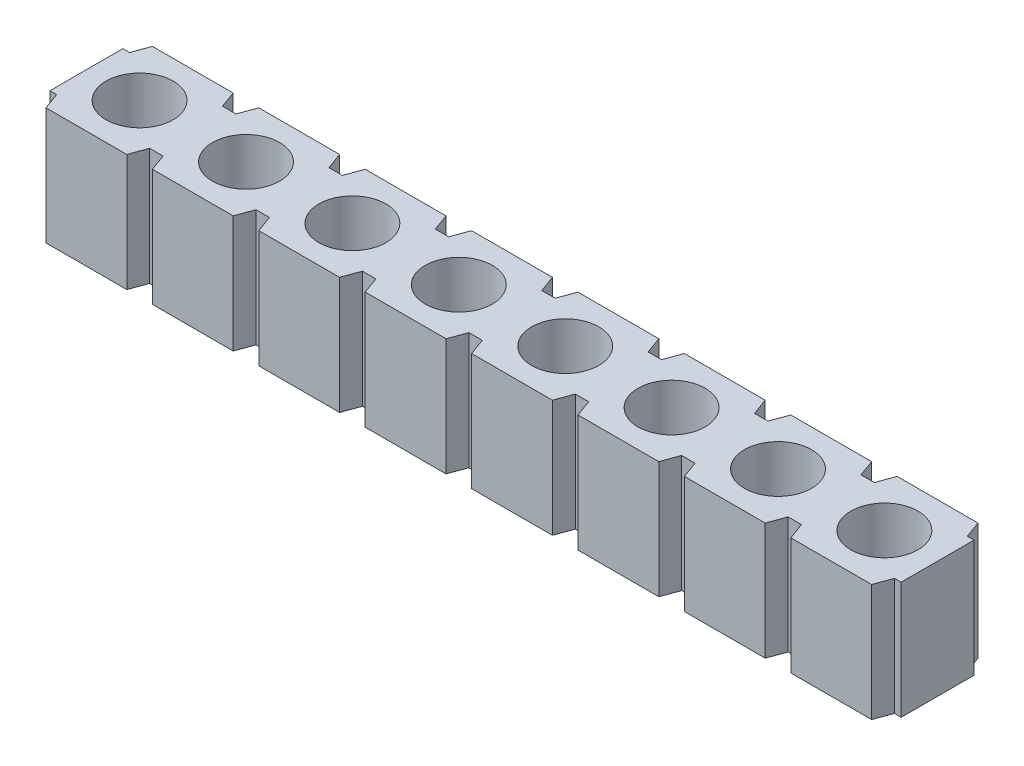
from build123d import *

# Parameters (mm, degrees)
EXTRUDE1_DEPTH  = 2.794
HOLE1_D         = 1.60274
EXTRUDE2_DEPTH  = 2.794
LPATTERN1_COUNT = 8
LPATTERN1_PITCH = 2.54
LPATTERN2_COUNT = 63
LPATTERN2_PITCH = 2.54


with BuildPart() as part:
    # Sketch1 → Extrude1 (new body)
    with BuildSketch(Plane(origin=(0, 0, 0), x_dir=(1, 0, 0), z_dir=(0, 1, 0))):
        Polygon((20.014373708, 0.40005), (19.854353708, 0.40005), (19.708747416, 0), (0, 0), (-0.145606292, 0.40005), (-0.305626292, 0.40005), (-0.305626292, 2.13995), (-0.145606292, 2.13995), (0, 2.54), (19.708747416, 2.54), (19.854353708, 2.13995), (20.014373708, 2.13995), align=None)
    extrude(amount=-EXTRUDE1_DEPTH)

    # Hole1 (through all)
    with Locations(Plane(origin=(0.964373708, 0, -1.27), x_dir=(0, 0, 1), z_dir=(0, 1, 0))):
        with Locations((0, 0)):
            hole1 = Hole(HOLE1_D / 2)

    # Sketch4 → Extrude2 (cut)
    with BuildSketch(Plane(origin=(0, 0, 0), x_dir=(1, 0, 0), z_dir=(0, 1, 0))):
        Polygon((1.928772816, 0), (2.5399746, 0), (2.394368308, 0.40005), (2.074379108, 0.40005), align=None)
        Polygon((2.074379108, 2.13995), (2.394368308, 2.13995), (2.5399746, 2.54), (1.928772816, 2.54), align=None)
    extrude2 = extrude(amount=-EXTRUDE2_DEPTH, mode=Mode.SUBTRACT)

    # LPattern1: Hole1 ×8
    with Locations(*[(i * LPATTERN1_PITCH, 0, 0) for i in range(1, LPATTERN1_COUNT)]):
        add(hole1, mode=Mode.SUBTRACT)

    # LPattern2: Extrude2 ×63
    with Locations(*[(i * LPATTERN2_PITCH, 0, 0) for i in range(1, LPATTERN2_COUNT)]):
        add(extrude2, mode=Mode.SUBTRACT)


solid = part.part
